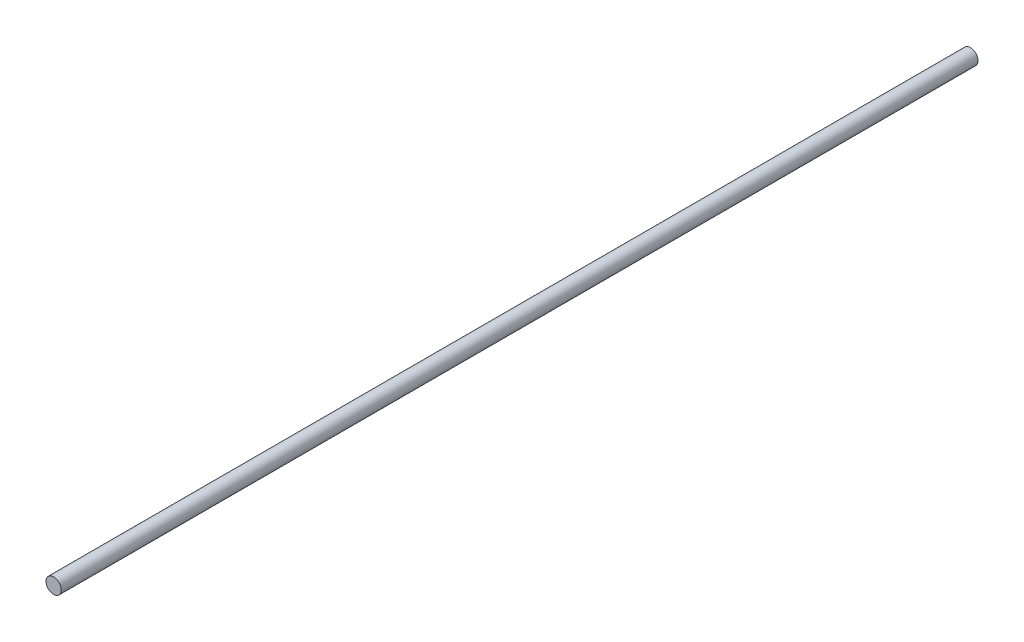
ISO-10303-21;
HEADER;
FILE_DESCRIPTION(('STEP AP214'),'2;1');
FILE_NAME('part.step','',(''),(''),'','','');
FILE_SCHEMA(('AUTOMOTIVE_DESIGN { 1 0 10303 214 1 1 1 1 }'));
ENDSEC;
DATA;
#1=APPLICATION_CONTEXT('core data for automotive mechanical design processes');
#2=APPLICATION_PROTOCOL_DEFINITION('international standard','automotive_design',2000,#1);
#3=PRODUCT_CONTEXT('',#1,'mechanical');
#4=PRODUCT('Part','Part','',(#3));
#5=PRODUCT_RELATED_PRODUCT_CATEGORY('part','',(#4));
#6=PRODUCT_DEFINITION_FORMATION('','',#4);
#7=PRODUCT_DEFINITION_CONTEXT('part definition',#1,'design');
#8=PRODUCT_DEFINITION('design','',#6,#7);
#9=PRODUCT_DEFINITION_SHAPE('','',#8);
#10=(LENGTH_UNIT() NAMED_UNIT(*) SI_UNIT(.MILLI.,.METRE.));
#11=(NAMED_UNIT(*) PLANE_ANGLE_UNIT() SI_UNIT($,.RADIAN.));
#12=(NAMED_UNIT(*) SI_UNIT($,.STERADIAN.) SOLID_ANGLE_UNIT());
#13=UNCERTAINTY_MEASURE_WITH_UNIT(LENGTH_MEASURE(1.E-05),#10,'distance_accuracy_value','');
#14=(GEOMETRIC_REPRESENTATION_CONTEXT(3) GLOBAL_UNCERTAINTY_ASSIGNED_CONTEXT((#13)) GLOBAL_UNIT_ASSIGNED_CONTEXT((#10,
#11,#12)) REPRESENTATION_CONTEXT('',''));
#15=CARTESIAN_POINT('',(0.,0.,0.));
#16=DIRECTION('',(0.,0.,1.));
#17=DIRECTION('',(1.,0.,0.));
#18=AXIS2_PLACEMENT_3D('',#15,#16,#17);
#19=CARTESIAN_POINT('',(0.,0.,-3600.));
#20=DIRECTION('',(0.,0.,1.));
#21=DIRECTION('',(1.,0.,0.));
#22=AXIS2_PLACEMENT_3D('',#19,#20,#21);
#23=CYLINDRICAL_SURFACE('',#22,30.);
#24=CARTESIAN_POINT('',(0.,0.,-3600.));
#25=DIRECTION('',(0.,0.,1.));
#26=DIRECTION('',(1.,0.,0.));
#27=AXIS2_PLACEMENT_3D('',#24,#25,#26);
#28=CIRCLE('',#27,30.);
#29=CARTESIAN_POINT('',(30.,0.,-3600.));
#30=VERTEX_POINT('',#29);
#31=EDGE_CURVE('E10',#30,#30,#28,.T.);
#32=ORIENTED_EDGE('',*,*,#31,.T.);
#33=EDGE_LOOP('',(#32));
#34=FACE_BOUND('',#33,.T.);
#35=CARTESIAN_POINT('',(0.,0.,0.));
#36=DIRECTION('',(0.,0.,1.));
#37=DIRECTION('',(1.,0.,0.));
#38=AXIS2_PLACEMENT_3D('',#35,#36,#37);
#39=CIRCLE('',#38,30.);
#40=CARTESIAN_POINT('',(30.,0.,0.));
#41=VERTEX_POINT('',#40);
#42=EDGE_CURVE('E40',#41,#41,#39,.T.);
#43=ORIENTED_EDGE('',*,*,#42,.F.);
#44=EDGE_LOOP('',(#43));
#45=FACE_BOUND('',#44,.T.);
#46=ADVANCED_FACE('F37',(#34,#45),#23,.T.);
#47=CARTESIAN_POINT('',(0.,0.,-3600.));
#48=DIRECTION('',(0.,0.,1.));
#49=DIRECTION('',(1.,0.,0.));
#50=AXIS2_PLACEMENT_3D('',#47,#48,#49);
#51=PLANE('',#50);
#52=ORIENTED_EDGE('',*,*,#31,.F.);
#53=EDGE_LOOP('',(#52));
#54=FACE_BOUND('',#53,.T.);
#55=ADVANCED_FACE('F54',(#54),#51,.F.);
#56=CARTESIAN_POINT('',(0.,0.,0.));
#57=DIRECTION('',(0.,0.,1.));
#58=DIRECTION('',(1.,0.,0.));
#59=AXIS2_PLACEMENT_3D('',#56,#57,#58);
#60=PLANE('',#59);
#61=ORIENTED_EDGE('',*,*,#42,.T.);
#62=EDGE_LOOP('',(#61));
#63=FACE_BOUND('',#62,.T.);
#64=ADVANCED_FACE('F51',(#63),#60,.T.);
#65=CLOSED_SHELL('',(#46,#55,#64));
#66=MANIFOLD_SOLID_BREP('B2',#65);
#67=ADVANCED_BREP_SHAPE_REPRESENTATION('',(#18,#66),#14);
#68=SHAPE_DEFINITION_REPRESENTATION(#9,#67);
ENDSEC;
END-ISO-10303-21;
